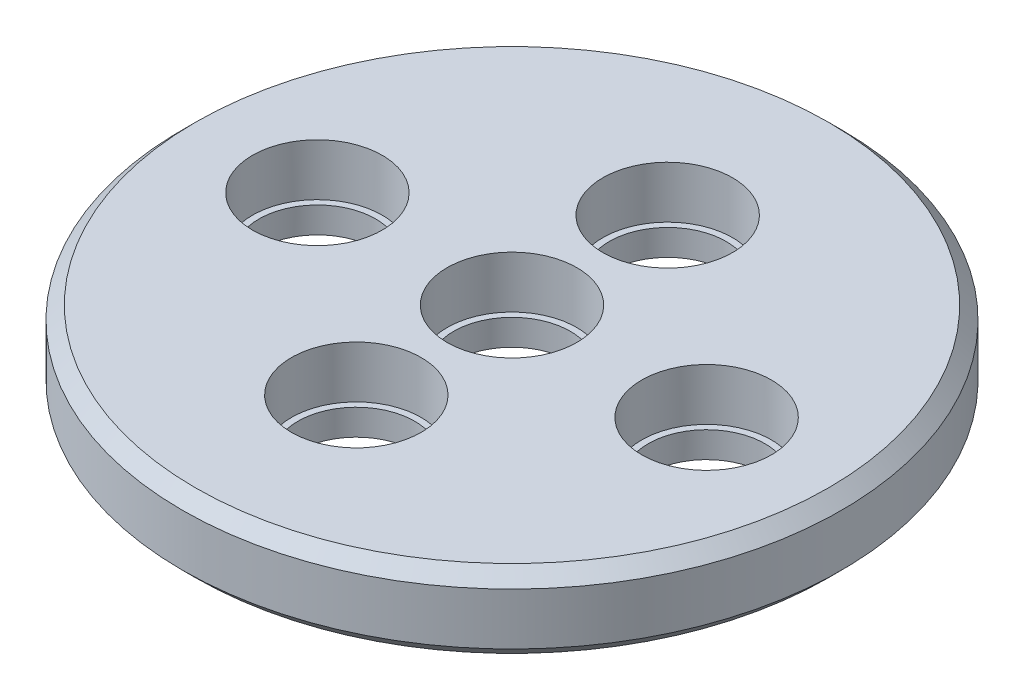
ISO-10303-21;
HEADER;
FILE_DESCRIPTION(('STEP AP214'),'2;1');
FILE_NAME('part.step','',(''),(''),'','','');
FILE_SCHEMA(('AUTOMOTIVE_DESIGN { 1 0 10303 214 1 1 1 1 }'));
ENDSEC;
DATA;
#1=APPLICATION_CONTEXT('core data for automotive mechanical design processes');
#2=APPLICATION_PROTOCOL_DEFINITION('international standard','automotive_design',2000,#1);
#3=PRODUCT_CONTEXT('',#1,'mechanical');
#4=PRODUCT('Part','Part','',(#3));
#5=PRODUCT_RELATED_PRODUCT_CATEGORY('part','',(#4));
#6=PRODUCT_DEFINITION_FORMATION('','',#4);
#7=PRODUCT_DEFINITION_CONTEXT('part definition',#1,'design');
#8=PRODUCT_DEFINITION('design','',#6,#7);
#9=PRODUCT_DEFINITION_SHAPE('','',#8);
#10=(LENGTH_UNIT() NAMED_UNIT(*) SI_UNIT(.MILLI.,.METRE.));
#11=(NAMED_UNIT(*) PLANE_ANGLE_UNIT() SI_UNIT($,.RADIAN.));
#12=(NAMED_UNIT(*) SI_UNIT($,.STERADIAN.) SOLID_ANGLE_UNIT());
#13=UNCERTAINTY_MEASURE_WITH_UNIT(LENGTH_MEASURE(1.E-05),#10,'distance_accuracy_value','');
#14=(GEOMETRIC_REPRESENTATION_CONTEXT(3) GLOBAL_UNCERTAINTY_ASSIGNED_CONTEXT((#13)) GLOBAL_UNIT_ASSIGNED_CONTEXT((#10,
#11,#12)) REPRESENTATION_CONTEXT('',''));
#15=CARTESIAN_POINT('',(0.,0.,0.));
#16=DIRECTION('',(0.,0.,1.));
#17=DIRECTION('',(1.,0.,0.));
#18=AXIS2_PLACEMENT_3D('',#15,#16,#17);
#19=CARTESIAN_POINT('',(0.,3.,0.));
#20=DIRECTION('',(0.,-1.,0.));
#21=DIRECTION('',(0.,0.,-1.));
#22=AXIS2_PLACEMENT_3D('',#19,#20,#21);
#23=CYLINDRICAL_SURFACE('',#22,12.7);
#24=CARTESIAN_POINT('',(0.,2.5,0.));
#25=DIRECTION('',(0.,1.,0.));
#26=DIRECTION('',(0.,0.,1.));
#27=AXIS2_PLACEMENT_3D('',#24,#25,#26);
#28=CIRCLE('',#27,12.7);
#29=CARTESIAN_POINT('',(0.,2.5,12.7));
#30=VERTEX_POINT('',#29);
#31=EDGE_CURVE('E47',#30,#30,#28,.F.);
#32=ORIENTED_EDGE('',*,*,#31,.T.);
#33=EDGE_LOOP('',(#32));
#34=FACE_BOUND('',#33,.T.);
#35=CARTESIAN_POINT('',(0.,0.500000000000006,0.));
#36=DIRECTION('',(0.,1.,0.));
#37=DIRECTION('',(0.,0.,1.));
#38=AXIS2_PLACEMENT_3D('',#35,#36,#37);
#39=CIRCLE('',#38,12.7);
#40=CARTESIAN_POINT('',(0.,0.500000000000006,12.7));
#41=VERTEX_POINT('',#40);
#42=EDGE_CURVE('E51',#41,#41,#39,.T.);
#43=ORIENTED_EDGE('',*,*,#42,.T.);
#44=EDGE_LOOP('',(#43));
#45=FACE_BOUND('',#44,.T.);
#46=ADVANCED_FACE('F39',(#34,#45),#23,.T.);
#47=CARTESIAN_POINT('',(0.,3.,0.));
#48=DIRECTION('',(0.,1.,0.));
#49=DIRECTION('',(0.,0.,1.));
#50=AXIS2_PLACEMENT_3D('',#47,#48,#49);
#51=PLANE('',#50);
#52=CARTESIAN_POINT('',(0.,3.,0.));
#53=DIRECTION('',(0.,1.,0.));
#54=DIRECTION('',(0.,0.,1.));
#55=AXIS2_PLACEMENT_3D('',#52,#53,#54);
#56=CIRCLE('',#55,12.2);
#57=CARTESIAN_POINT('',(0.,3.,12.2));
#58=VERTEX_POINT('',#57);
#59=EDGE_CURVE('E55',#58,#58,#56,.T.);
#60=ORIENTED_EDGE('',*,*,#59,.T.);
#61=EDGE_LOOP('',(#60));
#62=FACE_BOUND('',#61,.T.);
#63=CARTESIAN_POINT('',(7.5,3.,0.));
#64=DIRECTION('',(0.,1.,0.));
#65=DIRECTION('',(-1.,0.,0.));
#66=AXIS2_PLACEMENT_3D('',#63,#64,#65);
#67=CIRCLE('',#66,2.5);
#68=CARTESIAN_POINT('',(5.,3.,0.));
#69=VERTEX_POINT('',#68);
#70=EDGE_CURVE('E64',#69,#69,#67,.T.);
#71=ORIENTED_EDGE('',*,*,#70,.F.);
#72=EDGE_LOOP('',(#71));
#73=FACE_BOUND('',#72,.T.);
#74=CARTESIAN_POINT('',(-7.5,3.,0.));
#75=DIRECTION('',(0.,1.,0.));
#76=DIRECTION('',(-1.,0.,0.));
#77=AXIS2_PLACEMENT_3D('',#74,#75,#76);
#78=CIRCLE('',#77,2.5);
#79=CARTESIAN_POINT('',(-10.,3.,0.));
#80=VERTEX_POINT('',#79);
#81=EDGE_CURVE('E108',#80,#80,#78,.T.);
#82=ORIENTED_EDGE('',*,*,#81,.F.);
#83=EDGE_LOOP('',(#82));
#84=FACE_BOUND('',#83,.T.);
#85=CARTESIAN_POINT('',(0.,3.,-6.));
#86=DIRECTION('',(0.,1.,0.));
#87=DIRECTION('',(0.,0.,1.));
#88=AXIS2_PLACEMENT_3D('',#85,#86,#87);
#89=CIRCLE('',#88,2.5);
#90=CARTESIAN_POINT('',(0.,3.,-3.5));
#91=VERTEX_POINT('',#90);
#92=EDGE_CURVE('E86',#91,#91,#89,.T.);
#93=ORIENTED_EDGE('',*,*,#92,.F.);
#94=EDGE_LOOP('',(#93));
#95=FACE_BOUND('',#94,.T.);
#96=CARTESIAN_POINT('',(0.,3.,6.));
#97=DIRECTION('',(0.,1.,0.));
#98=DIRECTION('',(0.,0.,1.));
#99=AXIS2_PLACEMENT_3D('',#96,#97,#98);
#100=CIRCLE('',#99,2.5);
#101=CARTESIAN_POINT('',(0.,3.,8.5));
#102=VERTEX_POINT('',#101);
#103=EDGE_CURVE('E85',#102,#102,#100,.T.);
#104=ORIENTED_EDGE('',*,*,#103,.F.);
#105=EDGE_LOOP('',(#104));
#106=FACE_BOUND('',#105,.T.);
#107=CARTESIAN_POINT('',(0.,3.,0.));
#108=DIRECTION('',(0.,1.,0.));
#109=DIRECTION('',(0.,0.,1.));
#110=AXIS2_PLACEMENT_3D('',#107,#108,#109);
#111=CIRCLE('',#110,2.5);
#112=CARTESIAN_POINT('',(0.,3.,2.5));
#113=VERTEX_POINT('',#112);
#114=EDGE_CURVE('E82',#113,#113,#111,.T.);
#115=ORIENTED_EDGE('',*,*,#114,.F.);
#116=EDGE_LOOP('',(#115));
#117=FACE_BOUND('',#116,.T.);
#118=ADVANCED_FACE('F139',(#62,#73,#84,#95,#106,#117),#51,.T.);
#119=CARTESIAN_POINT('',(0.,0.,0.));
#120=DIRECTION('',(0.,1.,0.));
#121=DIRECTION('',(0.,0.,1.));
#122=AXIS2_PLACEMENT_3D('',#119,#120,#121);
#123=PLANE('',#122);
#124=CARTESIAN_POINT('',(0.,0.,0.));
#125=DIRECTION('',(0.,1.,0.));
#126=DIRECTION('',(0.,0.,1.));
#127=AXIS2_PLACEMENT_3D('',#124,#125,#126);
#128=CIRCLE('',#127,12.2);
#129=CARTESIAN_POINT('',(0.,0.,12.2));
#130=VERTEX_POINT('',#129);
#131=EDGE_CURVE('E11',#130,#130,#128,.F.);
#132=ORIENTED_EDGE('',*,*,#131,.T.);
#133=EDGE_LOOP('',(#132));
#134=FACE_BOUND('',#133,.T.);
#135=CARTESIAN_POINT('',(7.5,0.,0.));
#136=DIRECTION('',(0.,1.,0.));
#137=DIRECTION('',(-1.,0.,0.));
#138=AXIS2_PLACEMENT_3D('',#135,#136,#137);
#139=CIRCLE('',#138,2.25);
#140=CARTESIAN_POINT('',(5.25,0.,0.));
#141=VERTEX_POINT('',#140);
#142=EDGE_CURVE('E115',#141,#141,#139,.T.);
#143=ORIENTED_EDGE('',*,*,#142,.T.);
#144=EDGE_LOOP('',(#143));
#145=FACE_BOUND('',#144,.T.);
#146=CARTESIAN_POINT('',(-7.5,0.,0.));
#147=DIRECTION('',(0.,1.,0.));
#148=DIRECTION('',(-1.,0.,0.));
#149=AXIS2_PLACEMENT_3D('',#146,#147,#148);
#150=CIRCLE('',#149,2.25);
#151=CARTESIAN_POINT('',(-9.75,0.,0.));
#152=VERTEX_POINT('',#151);
#153=EDGE_CURVE('E68',#152,#152,#150,.T.);
#154=ORIENTED_EDGE('',*,*,#153,.T.);
#155=EDGE_LOOP('',(#154));
#156=FACE_BOUND('',#155,.T.);
#157=CARTESIAN_POINT('',(0.,0.,-6.));
#158=DIRECTION('',(0.,1.,0.));
#159=DIRECTION('',(0.,0.,1.));
#160=AXIS2_PLACEMENT_3D('',#157,#158,#159);
#161=CIRCLE('',#160,2.25);
#162=CARTESIAN_POINT('',(0.,0.,-3.75));
#163=VERTEX_POINT('',#162);
#164=EDGE_CURVE('E99',#163,#163,#161,.T.);
#165=ORIENTED_EDGE('',*,*,#164,.T.);
#166=EDGE_LOOP('',(#165));
#167=FACE_BOUND('',#166,.T.);
#168=CARTESIAN_POINT('',(0.,0.,6.));
#169=DIRECTION('',(0.,1.,0.));
#170=DIRECTION('',(0.,0.,1.));
#171=AXIS2_PLACEMENT_3D('',#168,#169,#170);
#172=CIRCLE('',#171,2.25);
#173=CARTESIAN_POINT('',(0.,0.,8.25));
#174=VERTEX_POINT('',#173);
#175=EDGE_CURVE('E98',#174,#174,#172,.T.);
#176=ORIENTED_EDGE('',*,*,#175,.T.);
#177=EDGE_LOOP('',(#176));
#178=FACE_BOUND('',#177,.T.);
#179=CARTESIAN_POINT('',(0.,0.,0.));
#180=DIRECTION('',(0.,1.,0.));
#181=DIRECTION('',(0.,0.,1.));
#182=AXIS2_PLACEMENT_3D('',#179,#180,#181);
#183=CIRCLE('',#182,2.25);
#184=CARTESIAN_POINT('',(0.,0.,2.25));
#185=VERTEX_POINT('',#184);
#186=EDGE_CURVE('E79',#185,#185,#183,.T.);
#187=ORIENTED_EDGE('',*,*,#186,.T.);
#188=EDGE_LOOP('',(#187));
#189=FACE_BOUND('',#188,.T.);
#190=ADVANCED_FACE('F121',(#134,#145,#156,#167,#178,#189),#123,.F.);
#191=CARTESIAN_POINT('',(0.,-7.07106781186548,0.));
#192=DIRECTION('',(0.,1.,0.));
#193=DIRECTION('',(0.,0.,1.));
#194=AXIS2_PLACEMENT_3D('',#191,#192,#193);
#195=CYLINDRICAL_SURFACE('',#194,2.5);
#196=CARTESIAN_POINT('',(0.,1.,0.));
#197=DIRECTION('',(0.,1.,0.));
#198=DIRECTION('',(0.,0.,1.));
#199=AXIS2_PLACEMENT_3D('',#196,#197,#198);
#200=CIRCLE('',#199,2.5);
#201=CARTESIAN_POINT('',(0.,1.,2.5));
#202=VERTEX_POINT('',#201);
#203=EDGE_CURVE('E60',#202,#202,#200,.F.);
#204=ORIENTED_EDGE('',*,*,#203,.T.);
#205=EDGE_LOOP('',(#204));
#206=FACE_BOUND('',#205,.T.);
#207=ORIENTED_EDGE('',*,*,#114,.T.);
#208=EDGE_LOOP('',(#207));
#209=FACE_BOUND('',#208,.T.);
#210=ADVANCED_FACE('F154',(#206,#209),#195,.F.);
#211=CARTESIAN_POINT('',(0.,1.,0.));
#212=DIRECTION('',(0.,1.,0.));
#213=DIRECTION('',(0.,0.,1.));
#214=AXIS2_PLACEMENT_3D('',#211,#212,#213);
#215=PLANE('',#214);
#216=CARTESIAN_POINT('',(0.,1.,0.));
#217=DIRECTION('',(0.,1.,0.));
#218=DIRECTION('',(0.,0.,1.));
#219=AXIS2_PLACEMENT_3D('',#216,#217,#218);
#220=CIRCLE('',#219,2.25);
#221=CARTESIAN_POINT('',(0.,1.,2.25));
#222=VERTEX_POINT('',#221);
#223=EDGE_CURVE('E69',#222,#222,#220,.T.);
#224=ORIENTED_EDGE('',*,*,#223,.F.);
#225=EDGE_LOOP('',(#224));
#226=FACE_BOUND('',#225,.T.);
#227=ORIENTED_EDGE('',*,*,#203,.F.);
#228=EDGE_LOOP('',(#227));
#229=FACE_BOUND('',#228,.T.);
#230=ADVANCED_FACE('F158',(#226,#229),#215,.T.);
#231=CARTESIAN_POINT('',(0.,-7.07106781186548,6.));
#232=DIRECTION('',(0.,1.,0.));
#233=DIRECTION('',(0.,0.,1.));
#234=AXIS2_PLACEMENT_3D('',#231,#232,#233);
#235=CYLINDRICAL_SURFACE('',#234,2.5);
#236=CARTESIAN_POINT('',(0.,1.,6.));
#237=DIRECTION('',(0.,1.,0.));
#238=DIRECTION('',(0.,0.,1.));
#239=AXIS2_PLACEMENT_3D('',#236,#237,#238);
#240=CIRCLE('',#239,2.5);
#241=CARTESIAN_POINT('',(0.,1.,8.5));
#242=VERTEX_POINT('',#241);
#243=EDGE_CURVE('E89',#242,#242,#240,.F.);
#244=ORIENTED_EDGE('',*,*,#243,.T.);
#245=EDGE_LOOP('',(#244));
#246=FACE_BOUND('',#245,.T.);
#247=ORIENTED_EDGE('',*,*,#103,.T.);
#248=EDGE_LOOP('',(#247));
#249=FACE_BOUND('',#248,.T.);
#250=ADVANCED_FACE('F162',(#246,#249),#235,.F.);
#251=CARTESIAN_POINT('',(0.,1.,0.));
#252=DIRECTION('',(0.,1.,0.));
#253=DIRECTION('',(0.,0.,1.));
#254=AXIS2_PLACEMENT_3D('',#251,#252,#253);
#255=PLANE('',#254);
#256=CARTESIAN_POINT('',(0.,1.,6.));
#257=DIRECTION('',(0.,1.,0.));
#258=DIRECTION('',(0.,0.,1.));
#259=AXIS2_PLACEMENT_3D('',#256,#257,#258);
#260=CIRCLE('',#259,2.25);
#261=CARTESIAN_POINT('',(0.,1.,8.25));
#262=VERTEX_POINT('',#261);
#263=EDGE_CURVE('E73',#262,#262,#260,.T.);
#264=ORIENTED_EDGE('',*,*,#263,.F.);
#265=EDGE_LOOP('',(#264));
#266=FACE_BOUND('',#265,.T.);
#267=ORIENTED_EDGE('',*,*,#243,.F.);
#268=EDGE_LOOP('',(#267));
#269=FACE_BOUND('',#268,.T.);
#270=ADVANCED_FACE('F172',(#266,#269),#255,.T.);
#271=CARTESIAN_POINT('',(0.,-7.07106781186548,-6.));
#272=DIRECTION('',(0.,1.,0.));
#273=DIRECTION('',(0.,0.,1.));
#274=AXIS2_PLACEMENT_3D('',#271,#272,#273);
#275=CYLINDRICAL_SURFACE('',#274,2.5);
#276=CARTESIAN_POINT('',(0.,1.,-6.));
#277=DIRECTION('',(0.,1.,0.));
#278=DIRECTION('',(0.,0.,1.));
#279=AXIS2_PLACEMENT_3D('',#276,#277,#278);
#280=CIRCLE('',#279,2.5);
#281=CARTESIAN_POINT('',(0.,1.,-3.5));
#282=VERTEX_POINT('',#281);
#283=EDGE_CURVE('E72',#282,#282,#280,.F.);
#284=ORIENTED_EDGE('',*,*,#283,.T.);
#285=EDGE_LOOP('',(#284));
#286=FACE_BOUND('',#285,.T.);
#287=ORIENTED_EDGE('',*,*,#92,.T.);
#288=EDGE_LOOP('',(#287));
#289=FACE_BOUND('',#288,.T.);
#290=ADVANCED_FACE('F168',(#286,#289),#275,.F.);
#291=CARTESIAN_POINT('',(0.,1.,0.));
#292=DIRECTION('',(0.,1.,0.));
#293=DIRECTION('',(0.,0.,1.));
#294=AXIS2_PLACEMENT_3D('',#291,#292,#293);
#295=PLANE('',#294);
#296=CARTESIAN_POINT('',(0.,1.,-6.));
#297=DIRECTION('',(0.,1.,0.));
#298=DIRECTION('',(0.,0.,1.));
#299=AXIS2_PLACEMENT_3D('',#296,#297,#298);
#300=CIRCLE('',#299,2.25);
#301=CARTESIAN_POINT('',(0.,1.,-3.75));
#302=VERTEX_POINT('',#301);
#303=EDGE_CURVE('E76',#302,#302,#300,.T.);
#304=ORIENTED_EDGE('',*,*,#303,.F.);
#305=EDGE_LOOP('',(#304));
#306=FACE_BOUND('',#305,.T.);
#307=ORIENTED_EDGE('',*,*,#283,.F.);
#308=EDGE_LOOP('',(#307));
#309=FACE_BOUND('',#308,.T.);
#310=ADVANCED_FACE('F164',(#306,#309),#295,.T.);
#311=CARTESIAN_POINT('',(0.,0.,-6.));
#312=DIRECTION('',(0.,1.,0.));
#313=DIRECTION('',(0.,0.,1.));
#314=AXIS2_PLACEMENT_3D('',#311,#312,#313);
#315=CYLINDRICAL_SURFACE('',#314,2.25);
#316=ORIENTED_EDGE('',*,*,#303,.T.);
#317=EDGE_LOOP('',(#316));
#318=FACE_BOUND('',#317,.T.);
#319=ORIENTED_EDGE('',*,*,#164,.F.);
#320=EDGE_LOOP('',(#319));
#321=FACE_BOUND('',#320,.T.);
#322=ADVANCED_FACE('F167',(#318,#321),#315,.F.);
#323=CARTESIAN_POINT('',(0.,0.,6.));
#324=DIRECTION('',(0.,1.,0.));
#325=DIRECTION('',(0.,0.,1.));
#326=AXIS2_PLACEMENT_3D('',#323,#324,#325);
#327=CYLINDRICAL_SURFACE('',#326,2.25);
#328=ORIENTED_EDGE('',*,*,#263,.T.);
#329=EDGE_LOOP('',(#328));
#330=FACE_BOUND('',#329,.T.);
#331=ORIENTED_EDGE('',*,*,#175,.F.);
#332=EDGE_LOOP('',(#331));
#333=FACE_BOUND('',#332,.T.);
#334=ADVANCED_FACE('F184',(#330,#333),#327,.F.);
#335=CARTESIAN_POINT('',(0.,0.,0.));
#336=DIRECTION('',(0.,1.,0.));
#337=DIRECTION('',(0.,0.,1.));
#338=AXIS2_PLACEMENT_3D('',#335,#336,#337);
#339=CYLINDRICAL_SURFACE('',#338,2.25);
#340=ORIENTED_EDGE('',*,*,#223,.T.);
#341=EDGE_LOOP('',(#340));
#342=FACE_BOUND('',#341,.T.);
#343=ORIENTED_EDGE('',*,*,#186,.F.);
#344=EDGE_LOOP('',(#343));
#345=FACE_BOUND('',#344,.T.);
#346=ADVANCED_FACE('F180',(#342,#345),#339,.F.);
#347=CARTESIAN_POINT('',(-7.5,-7.07106781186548,0.));
#348=DIRECTION('',(0.,1.,0.));
#349=DIRECTION('',(0.,0.,1.));
#350=AXIS2_PLACEMENT_3D('',#347,#348,#349);
#351=CYLINDRICAL_SURFACE('',#350,2.5);
#352=CARTESIAN_POINT('',(-7.5,1.,0.));
#353=DIRECTION('',(0.,1.,0.));
#354=DIRECTION('',(0.,0.,1.));
#355=AXIS2_PLACEMENT_3D('',#352,#353,#354);
#356=CIRCLE('',#355,2.5);
#357=CARTESIAN_POINT('',(-7.5,1.,2.49999999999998));
#358=VERTEX_POINT('',#357);
#359=EDGE_CURVE('E102',#358,#358,#356,.F.);
#360=ORIENTED_EDGE('',*,*,#359,.T.);
#361=EDGE_LOOP('',(#360));
#362=FACE_BOUND('',#361,.T.);
#363=ORIENTED_EDGE('',*,*,#81,.T.);
#364=EDGE_LOOP('',(#363));
#365=FACE_BOUND('',#364,.T.);
#366=ADVANCED_FACE('F183',(#362,#365),#351,.F.);
#367=CARTESIAN_POINT('',(0.,1.,0.));
#368=DIRECTION('',(0.,1.,0.));
#369=DIRECTION('',(0.,0.,1.));
#370=AXIS2_PLACEMENT_3D('',#367,#368,#369);
#371=PLANE('',#370);
#372=CARTESIAN_POINT('',(-7.5,1.,0.));
#373=DIRECTION('',(0.,1.,0.));
#374=DIRECTION('',(0.,0.,1.));
#375=AXIS2_PLACEMENT_3D('',#372,#373,#374);
#376=CIRCLE('',#375,2.25);
#377=CARTESIAN_POINT('',(-7.5,1.,2.24999999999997));
#378=VERTEX_POINT('',#377);
#379=EDGE_CURVE('E61',#378,#378,#376,.T.);
#380=ORIENTED_EDGE('',*,*,#379,.F.);
#381=EDGE_LOOP('',(#380));
#382=FACE_BOUND('',#381,.T.);
#383=ORIENTED_EDGE('',*,*,#359,.F.);
#384=EDGE_LOOP('',(#383));
#385=FACE_BOUND('',#384,.T.);
#386=ADVANCED_FACE('F195',(#382,#385),#371,.T.);
#387=CARTESIAN_POINT('',(7.5,-7.07106781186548,0.));
#388=DIRECTION('',(0.,1.,0.));
#389=DIRECTION('',(0.,0.,1.));
#390=AXIS2_PLACEMENT_3D('',#387,#388,#389);
#391=CYLINDRICAL_SURFACE('',#390,2.5);
#392=CARTESIAN_POINT('',(7.5,1.,0.));
#393=DIRECTION('',(0.,1.,0.));
#394=DIRECTION('',(0.,0.,1.));
#395=AXIS2_PLACEMENT_3D('',#392,#393,#394);
#396=CIRCLE('',#395,2.5);
#397=CARTESIAN_POINT('',(7.5,1.,2.50000000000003));
#398=VERTEX_POINT('',#397);
#399=EDGE_CURVE('E105',#398,#398,#396,.F.);
#400=ORIENTED_EDGE('',*,*,#399,.T.);
#401=EDGE_LOOP('',(#400));
#402=FACE_BOUND('',#401,.T.);
#403=ORIENTED_EDGE('',*,*,#70,.T.);
#404=EDGE_LOOP('',(#403));
#405=FACE_BOUND('',#404,.T.);
#406=ADVANCED_FACE('F192',(#402,#405),#391,.F.);
#407=CARTESIAN_POINT('',(0.,1.,0.));
#408=DIRECTION('',(0.,1.,0.));
#409=DIRECTION('',(0.,0.,1.));
#410=AXIS2_PLACEMENT_3D('',#407,#408,#409);
#411=PLANE('',#410);
#412=CARTESIAN_POINT('',(7.5,1.,0.));
#413=DIRECTION('',(0.,1.,0.));
#414=DIRECTION('',(0.,0.,1.));
#415=AXIS2_PLACEMENT_3D('',#412,#413,#414);
#416=CIRCLE('',#415,2.25);
#417=CARTESIAN_POINT('',(7.5,1.,2.25000000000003));
#418=VERTEX_POINT('',#417);
#419=EDGE_CURVE('E65',#418,#418,#416,.T.);
#420=ORIENTED_EDGE('',*,*,#419,.F.);
#421=EDGE_LOOP('',(#420));
#422=FACE_BOUND('',#421,.T.);
#423=ORIENTED_EDGE('',*,*,#399,.F.);
#424=EDGE_LOOP('',(#423));
#425=FACE_BOUND('',#424,.T.);
#426=ADVANCED_FACE('F135',(#422,#425),#411,.T.);
#427=CARTESIAN_POINT('',(7.5,0.,0.));
#428=DIRECTION('',(0.,1.,0.));
#429=DIRECTION('',(0.,0.,1.));
#430=AXIS2_PLACEMENT_3D('',#427,#428,#429);
#431=CYLINDRICAL_SURFACE('',#430,2.25);
#432=ORIENTED_EDGE('',*,*,#419,.T.);
#433=EDGE_LOOP('',(#432));
#434=FACE_BOUND('',#433,.T.);
#435=ORIENTED_EDGE('',*,*,#142,.F.);
#436=EDGE_LOOP('',(#435));
#437=FACE_BOUND('',#436,.T.);
#438=ADVANCED_FACE('F127',(#434,#437),#431,.F.);
#439=CARTESIAN_POINT('',(-7.5,0.,0.));
#440=DIRECTION('',(0.,1.,0.));
#441=DIRECTION('',(0.,0.,1.));
#442=AXIS2_PLACEMENT_3D('',#439,#440,#441);
#443=CYLINDRICAL_SURFACE('',#442,2.25);
#444=ORIENTED_EDGE('',*,*,#379,.T.);
#445=EDGE_LOOP('',(#444));
#446=FACE_BOUND('',#445,.T.);
#447=ORIENTED_EDGE('',*,*,#153,.F.);
#448=EDGE_LOOP('',(#447));
#449=FACE_BOUND('',#448,.T.);
#450=ADVANCED_FACE('F124',(#446,#449),#443,.F.);
#451=CARTESIAN_POINT('',(0.,3.,0.));
#452=DIRECTION('',(0.,-1.,0.));
#453=DIRECTION('',(0.,0.,-1.));
#454=AXIS2_PLACEMENT_3D('',#451,#452,#453);
#455=CONICAL_SURFACE('',#454,12.2,0.785398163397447);
#456=ORIENTED_EDGE('',*,*,#31,.F.);
#457=EDGE_LOOP('',(#456));
#458=FACE_BOUND('',#457,.T.);
#459=ORIENTED_EDGE('',*,*,#59,.F.);
#460=EDGE_LOOP('',(#459));
#461=FACE_BOUND('',#460,.T.);
#462=ADVANCED_FACE('F126',(#458,#461),#455,.T.);
#463=CARTESIAN_POINT('',(0.,0.500000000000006,0.));
#464=DIRECTION('',(0.,1.,0.));
#465=DIRECTION('',(0.,0.,1.));
#466=AXIS2_PLACEMENT_3D('',#463,#464,#465);
#467=CONICAL_SURFACE('',#466,12.7,0.785398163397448);
#468=ORIENTED_EDGE('',*,*,#131,.F.);
#469=EDGE_LOOP('',(#468));
#470=FACE_BOUND('',#469,.T.);
#471=ORIENTED_EDGE('',*,*,#42,.F.);
#472=EDGE_LOOP('',(#471));
#473=FACE_BOUND('',#472,.T.);
#474=ADVANCED_FACE('F42',(#470,#473),#467,.T.);
#475=CLOSED_SHELL('',(#46,#118,#190,#210,#230,#250,#270,#290,#310,#322,#334,#346,#366,#386,#406,
#426,#438,#450,#462,#474));
#476=MANIFOLD_SOLID_BREP('B2',#475);
#477=ADVANCED_BREP_SHAPE_REPRESENTATION('',(#18,#476),#14);
#478=SHAPE_DEFINITION_REPRESENTATION(#9,#477);
ENDSEC;
END-ISO-10303-21;
